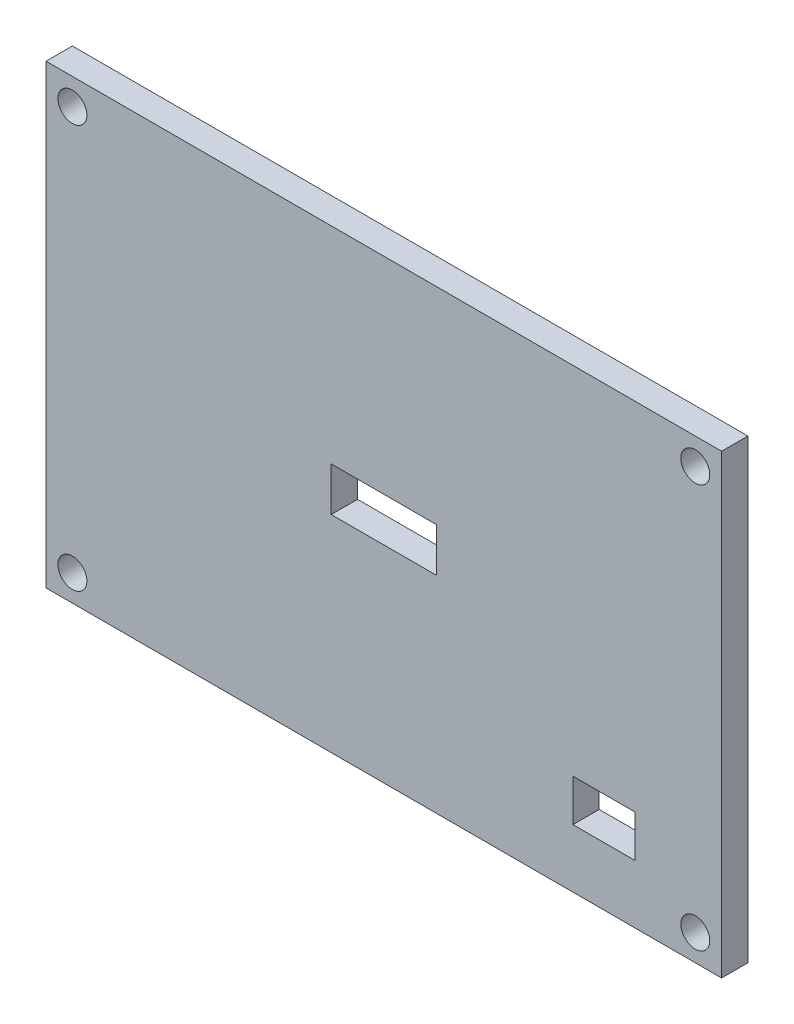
ISO-10303-21;
HEADER;
FILE_DESCRIPTION(('STEP AP214'),'2;1');
FILE_NAME('part.step','',(''),(''),'','','');
FILE_SCHEMA(('AUTOMOTIVE_DESIGN { 1 0 10303 214 1 1 1 1 }'));
ENDSEC;
DATA;
#1=APPLICATION_CONTEXT('core data for automotive mechanical design processes');
#2=APPLICATION_PROTOCOL_DEFINITION('international standard','automotive_design',2000,#1);
#3=PRODUCT_CONTEXT('',#1,'mechanical');
#4=PRODUCT('Part','Part','',(#3));
#5=PRODUCT_RELATED_PRODUCT_CATEGORY('part','',(#4));
#6=PRODUCT_DEFINITION_FORMATION('','',#4);
#7=PRODUCT_DEFINITION_CONTEXT('part definition',#1,'design');
#8=PRODUCT_DEFINITION('design','',#6,#7);
#9=PRODUCT_DEFINITION_SHAPE('','',#8);
#10=(LENGTH_UNIT() NAMED_UNIT(*) SI_UNIT(.MILLI.,.METRE.));
#11=(NAMED_UNIT(*) PLANE_ANGLE_UNIT() SI_UNIT($,.RADIAN.));
#12=(NAMED_UNIT(*) SI_UNIT($,.STERADIAN.) SOLID_ANGLE_UNIT());
#13=UNCERTAINTY_MEASURE_WITH_UNIT(LENGTH_MEASURE(1.E-05),#10,'distance_accuracy_value','');
#14=(GEOMETRIC_REPRESENTATION_CONTEXT(3) GLOBAL_UNCERTAINTY_ASSIGNED_CONTEXT((#13)) GLOBAL_UNIT_ASSIGNED_CONTEXT((#10,
#11,#12)) REPRESENTATION_CONTEXT('',''));
#15=CARTESIAN_POINT('',(0.,0.,0.));
#16=DIRECTION('',(0.,0.,1.));
#17=DIRECTION('',(1.,0.,0.));
#18=AXIS2_PLACEMENT_3D('',#15,#16,#17);
#19=CARTESIAN_POINT('',(0.,0.,3.));
#20=DIRECTION('',(0.,0.,-1.));
#21=DIRECTION('',(-1.,0.,0.));
#22=AXIS2_PLACEMENT_3D('',#19,#20,#21);
#23=PLANE('',#22);
#24=DIRECTION('',(0.,1.,0.));
#25=VECTOR('',#24,1.);
#26=CARTESIAN_POINT('',(6.,-2.5,3.));
#27=LINE('',#26,#25);
#28=CARTESIAN_POINT('',(6.,-2.5,3.));
#29=VERTEX_POINT('',#28);
#30=CARTESIAN_POINT('',(6.,2.5,3.));
#31=VERTEX_POINT('',#30);
#32=EDGE_CURVE('E168',#29,#31,#27,.T.);
#33=ORIENTED_EDGE('',*,*,#32,.F.);
#34=DIRECTION('',(1.,0.,0.));
#35=VECTOR('',#34,1.);
#36=CARTESIAN_POINT('',(-6.,-2.5,3.));
#37=LINE('',#36,#35);
#38=CARTESIAN_POINT('',(-6.,-2.5,3.));
#39=VERTEX_POINT('',#38);
#40=EDGE_CURVE('E176',#39,#29,#37,.T.);
#41=ORIENTED_EDGE('',*,*,#40,.F.);
#42=DIRECTION('',(0.,-1.,0.));
#43=VECTOR('',#42,1.);
#44=CARTESIAN_POINT('',(-6.,-2.5,3.));
#45=LINE('',#44,#43);
#46=CARTESIAN_POINT('',(-6.,2.5,3.));
#47=VERTEX_POINT('',#46);
#48=EDGE_CURVE('E173',#47,#39,#45,.T.);
#49=ORIENTED_EDGE('',*,*,#48,.F.);
#50=DIRECTION('',(-1.,0.,0.));
#51=VECTOR('',#50,1.);
#52=CARTESIAN_POINT('',(-6.,2.5,3.));
#53=LINE('',#52,#51);
#54=EDGE_CURVE('E170',#31,#47,#53,.T.);
#55=ORIENTED_EDGE('',*,*,#54,.F.);
#56=EDGE_LOOP('',(#33,#41,#49,#55));
#57=FACE_BOUND('',#56,.T.);
#58=DIRECTION('',(0.,1.,0.));
#59=VECTOR('',#58,1.);
#60=CARTESIAN_POINT('',(38.5,-26.,3.));
#61=LINE('',#60,#59);
#62=CARTESIAN_POINT('',(38.5,-26.,3.));
#63=VERTEX_POINT('',#62);
#64=CARTESIAN_POINT('',(38.5,26.,3.));
#65=VERTEX_POINT('',#64);
#66=EDGE_CURVE('E223',#63,#65,#61,.T.);
#67=ORIENTED_EDGE('',*,*,#66,.T.);
#68=DIRECTION('',(-1.,0.,0.));
#69=VECTOR('',#68,1.);
#70=CARTESIAN_POINT('',(-38.5,26.,3.));
#71=LINE('',#70,#69);
#72=CARTESIAN_POINT('',(-38.5,26.,3.));
#73=VERTEX_POINT('',#72);
#74=EDGE_CURVE('E226',#65,#73,#71,.T.);
#75=ORIENTED_EDGE('',*,*,#74,.T.);
#76=DIRECTION('',(0.,-1.,0.));
#77=VECTOR('',#76,1.);
#78=CARTESIAN_POINT('',(-38.5,-26.,3.));
#79=LINE('',#78,#77);
#80=CARTESIAN_POINT('',(-38.5,-26.,3.));
#81=VERTEX_POINT('',#80);
#82=EDGE_CURVE('E229',#73,#81,#79,.T.);
#83=ORIENTED_EDGE('',*,*,#82,.T.);
#84=DIRECTION('',(1.,0.,0.));
#85=VECTOR('',#84,1.);
#86=CARTESIAN_POINT('',(-38.5,-26.,3.));
#87=LINE('',#86,#85);
#88=EDGE_CURVE('E231',#81,#63,#87,.T.);
#89=ORIENTED_EDGE('',*,*,#88,.T.);
#90=EDGE_LOOP('',(#67,#75,#83,#89));
#91=FACE_BOUND('',#90,.T.);
#92=CARTESIAN_POINT('',(-35.5,23.,3.));
#93=DIRECTION('',(0.,0.,1.));
#94=DIRECTION('',(1.,0.,0.));
#95=AXIS2_PLACEMENT_3D('',#92,#93,#94);
#96=CIRCLE('',#95,1.65);
#97=CARTESIAN_POINT('',(-33.85,23.,3.));
#98=VERTEX_POINT('',#97);
#99=EDGE_CURVE('E217',#98,#98,#96,.T.);
#100=ORIENTED_EDGE('',*,*,#99,.F.);
#101=EDGE_LOOP('',(#100));
#102=FACE_BOUND('',#101,.T.);
#103=CARTESIAN_POINT('',(35.5,23.,3.));
#104=DIRECTION('',(0.,0.,1.));
#105=DIRECTION('',(-1.,0.,0.));
#106=AXIS2_PLACEMENT_3D('',#103,#104,#105);
#107=CIRCLE('',#106,1.65);
#108=CARTESIAN_POINT('',(33.85,23.,3.));
#109=VERTEX_POINT('',#108);
#110=EDGE_CURVE('E211',#109,#109,#107,.T.);
#111=ORIENTED_EDGE('',*,*,#110,.F.);
#112=EDGE_LOOP('',(#111));
#113=FACE_BOUND('',#112,.T.);
#114=CARTESIAN_POINT('',(35.5,-23.,3.));
#115=DIRECTION('',(0.,0.,1.));
#116=DIRECTION('',(1.,0.,0.));
#117=AXIS2_PLACEMENT_3D('',#114,#115,#116);
#118=CIRCLE('',#117,1.65);
#119=CARTESIAN_POINT('',(37.15,-23.,3.));
#120=VERTEX_POINT('',#119);
#121=EDGE_CURVE('E205',#120,#120,#118,.T.);
#122=ORIENTED_EDGE('',*,*,#121,.F.);
#123=EDGE_LOOP('',(#122));
#124=FACE_BOUND('',#123,.T.);
#125=CARTESIAN_POINT('',(-35.5,-23.,3.));
#126=DIRECTION('',(0.,0.,1.));
#127=DIRECTION('',(-1.,0.,0.));
#128=AXIS2_PLACEMENT_3D('',#125,#126,#127);
#129=CIRCLE('',#128,1.65);
#130=CARTESIAN_POINT('',(-37.15,-23.,3.));
#131=VERTEX_POINT('',#130);
#132=EDGE_CURVE('E199',#131,#131,#129,.T.);
#133=ORIENTED_EDGE('',*,*,#132,.F.);
#134=EDGE_LOOP('',(#133));
#135=FACE_BOUND('',#134,.T.);
#136=DIRECTION('',(0.,1.,0.));
#137=VECTOR('',#136,1.);
#138=CARTESIAN_POINT('',(28.6302930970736,-19.3347433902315,3.));
#139=LINE('',#138,#137);
#140=CARTESIAN_POINT('',(28.6302930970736,-19.3347433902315,3.));
#141=VERTEX_POINT('',#140);
#142=CARTESIAN_POINT('',(28.6302930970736,-14.5530946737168,3.));
#143=VERTEX_POINT('',#142);
#144=EDGE_CURVE('E132',#141,#143,#139,.T.);
#145=ORIENTED_EDGE('',*,*,#144,.F.);
#146=DIRECTION('',(1.,0.,0.));
#147=VECTOR('',#146,1.);
#148=CARTESIAN_POINT('',(28.6302930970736,-19.3347433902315,3.));
#149=LINE('',#148,#147);
#150=CARTESIAN_POINT('',(21.5497748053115,-19.3347433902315,3.));
#151=VERTEX_POINT('',#150);
#152=EDGE_CURVE('E154',#151,#141,#149,.T.);
#153=ORIENTED_EDGE('',*,*,#152,.F.);
#154=DIRECTION('',(0.,-1.,0.));
#155=VECTOR('',#154,1.);
#156=CARTESIAN_POINT('',(21.5497748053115,-19.3347433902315,3.));
#157=LINE('',#156,#155);
#158=CARTESIAN_POINT('',(21.5497748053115,-14.5530946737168,3.));
#159=VERTEX_POINT('',#158);
#160=EDGE_CURVE('E152',#159,#151,#157,.T.);
#161=ORIENTED_EDGE('',*,*,#160,.F.);
#162=DIRECTION('',(-1.,0.,0.));
#163=VECTOR('',#162,1.);
#164=CARTESIAN_POINT('',(28.6302930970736,-14.5530946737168,3.));
#165=LINE('',#164,#163);
#166=EDGE_CURVE('E140',#143,#159,#165,.T.);
#167=ORIENTED_EDGE('',*,*,#166,.F.);
#168=EDGE_LOOP('',(#145,#153,#161,#167));
#169=FACE_BOUND('',#168,.T.);
#170=ADVANCED_FACE('F43',(#57,#91,#102,#113,#124,#135,#169),#23,.F.);
#171=CARTESIAN_POINT('',(0.,0.,0.));
#172=DIRECTION('',(0.,0.,-1.));
#173=DIRECTION('',(-1.,0.,0.));
#174=AXIS2_PLACEMENT_3D('',#171,#172,#173);
#175=PLANE('',#174);
#176=CARTESIAN_POINT('',(35.5,-23.,0.));
#177=DIRECTION('',(0.,0.,1.));
#178=DIRECTION('',(1.,0.,0.));
#179=AXIS2_PLACEMENT_3D('',#176,#177,#178);
#180=CIRCLE('',#179,1.65);
#181=CARTESIAN_POINT('',(37.15,-23.,0.));
#182=VERTEX_POINT('',#181);
#183=EDGE_CURVE('E202',#182,#182,#180,.T.);
#184=ORIENTED_EDGE('',*,*,#183,.T.);
#185=EDGE_LOOP('',(#184));
#186=FACE_BOUND('',#185,.T.);
#187=CARTESIAN_POINT('',(-35.5,23.,0.));
#188=DIRECTION('',(0.,0.,1.));
#189=DIRECTION('',(1.,0.,0.));
#190=AXIS2_PLACEMENT_3D('',#187,#188,#189);
#191=CIRCLE('',#190,1.65);
#192=CARTESIAN_POINT('',(-33.85,23.,0.));
#193=VERTEX_POINT('',#192);
#194=EDGE_CURVE('E214',#193,#193,#191,.T.);
#195=ORIENTED_EDGE('',*,*,#194,.T.);
#196=EDGE_LOOP('',(#195));
#197=FACE_BOUND('',#196,.T.);
#198=DIRECTION('',(0.,1.,0.));
#199=VECTOR('',#198,1.);
#200=CARTESIAN_POINT('',(38.5,-26.,0.));
#201=LINE('',#200,#199);
#202=CARTESIAN_POINT('',(38.5,-26.,0.));
#203=VERTEX_POINT('',#202);
#204=CARTESIAN_POINT('',(38.5,26.,0.));
#205=VERTEX_POINT('',#204);
#206=EDGE_CURVE('E220',#203,#205,#201,.T.);
#207=ORIENTED_EDGE('',*,*,#206,.F.);
#208=DIRECTION('',(1.,0.,0.));
#209=VECTOR('',#208,1.);
#210=CARTESIAN_POINT('',(-38.5,-26.,0.));
#211=LINE('',#210,#209);
#212=CARTESIAN_POINT('',(-38.5,-26.,0.));
#213=VERTEX_POINT('',#212);
#214=EDGE_CURVE('E227',#213,#203,#211,.T.);
#215=ORIENTED_EDGE('',*,*,#214,.F.);
#216=DIRECTION('',(0.,-1.,0.));
#217=VECTOR('',#216,1.);
#218=CARTESIAN_POINT('',(-38.5,-26.,0.));
#219=LINE('',#218,#217);
#220=CARTESIAN_POINT('',(-38.5,26.,0.));
#221=VERTEX_POINT('',#220);
#222=EDGE_CURVE('E238',#221,#213,#219,.T.);
#223=ORIENTED_EDGE('',*,*,#222,.F.);
#224=DIRECTION('',(-1.,0.,0.));
#225=VECTOR('',#224,1.);
#226=CARTESIAN_POINT('',(-38.5,26.,0.));
#227=LINE('',#226,#225);
#228=EDGE_CURVE('E236',#205,#221,#227,.T.);
#229=ORIENTED_EDGE('',*,*,#228,.F.);
#230=EDGE_LOOP('',(#207,#215,#223,#229));
#231=FACE_BOUND('',#230,.T.);
#232=CARTESIAN_POINT('',(35.5,23.,0.));
#233=DIRECTION('',(0.,0.,1.));
#234=DIRECTION('',(-1.,0.,0.));
#235=AXIS2_PLACEMENT_3D('',#232,#233,#234);
#236=CIRCLE('',#235,1.65);
#237=CARTESIAN_POINT('',(33.85,23.,0.));
#238=VERTEX_POINT('',#237);
#239=EDGE_CURVE('E208',#238,#238,#236,.T.);
#240=ORIENTED_EDGE('',*,*,#239,.T.);
#241=EDGE_LOOP('',(#240));
#242=FACE_BOUND('',#241,.T.);
#243=CARTESIAN_POINT('',(-35.5,-23.,0.));
#244=DIRECTION('',(0.,0.,1.));
#245=DIRECTION('',(-1.,0.,0.));
#246=AXIS2_PLACEMENT_3D('',#243,#244,#245);
#247=CIRCLE('',#246,1.65);
#248=CARTESIAN_POINT('',(-37.15,-23.,0.));
#249=VERTEX_POINT('',#248);
#250=EDGE_CURVE('E198',#249,#249,#247,.T.);
#251=ORIENTED_EDGE('',*,*,#250,.T.);
#252=EDGE_LOOP('',(#251));
#253=FACE_BOUND('',#252,.T.);
#254=DIRECTION('',(1.,0.,0.));
#255=VECTOR('',#254,1.);
#256=CARTESIAN_POINT('',(-6.,-2.5,0.));
#257=LINE('',#256,#255);
#258=CARTESIAN_POINT('',(-6.,-2.5,0.));
#259=VERTEX_POINT('',#258);
#260=CARTESIAN_POINT('',(6.,-2.5,0.));
#261=VERTEX_POINT('',#260);
#262=EDGE_CURVE('E171',#259,#261,#257,.T.);
#263=ORIENTED_EDGE('',*,*,#262,.T.);
#264=DIRECTION('',(0.,1.,0.));
#265=VECTOR('',#264,1.);
#266=CARTESIAN_POINT('',(6.,-2.5,0.));
#267=LINE('',#266,#265);
#268=CARTESIAN_POINT('',(6.,2.5,0.));
#269=VERTEX_POINT('',#268);
#270=EDGE_CURVE('E148',#261,#269,#267,.T.);
#271=ORIENTED_EDGE('',*,*,#270,.T.);
#272=DIRECTION('',(-1.,0.,0.));
#273=VECTOR('',#272,1.);
#274=CARTESIAN_POINT('',(-6.,2.5,0.));
#275=LINE('',#274,#273);
#276=CARTESIAN_POINT('',(-6.,2.5,0.));
#277=VERTEX_POINT('',#276);
#278=EDGE_CURVE('E181',#269,#277,#275,.T.);
#279=ORIENTED_EDGE('',*,*,#278,.T.);
#280=DIRECTION('',(0.,-1.,0.));
#281=VECTOR('',#280,1.);
#282=CARTESIAN_POINT('',(-6.,-2.5,0.));
#283=LINE('',#282,#281);
#284=EDGE_CURVE('E184',#277,#259,#283,.T.);
#285=ORIENTED_EDGE('',*,*,#284,.T.);
#286=EDGE_LOOP('',(#263,#271,#279,#285));
#287=FACE_BOUND('',#286,.T.);
#288=DIRECTION('',(1.,0.,0.));
#289=VECTOR('',#288,1.);
#290=CARTESIAN_POINT('',(28.6302930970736,-19.3347433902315,0.));
#291=LINE('',#290,#289);
#292=CARTESIAN_POINT('',(21.5497748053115,-19.3347433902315,0.));
#293=VERTEX_POINT('',#292);
#294=CARTESIAN_POINT('',(28.6302930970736,-19.3347433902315,0.));
#295=VERTEX_POINT('',#294);
#296=EDGE_CURVE('E141',#293,#295,#291,.T.);
#297=ORIENTED_EDGE('',*,*,#296,.T.);
#298=DIRECTION('',(0.,1.,0.));
#299=VECTOR('',#298,1.);
#300=CARTESIAN_POINT('',(28.6302930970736,-19.3347433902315,0.));
#301=LINE('',#300,#299);
#302=CARTESIAN_POINT('',(28.6302930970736,-14.5530946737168,0.));
#303=VERTEX_POINT('',#302);
#304=EDGE_CURVE('E66',#295,#303,#301,.T.);
#305=ORIENTED_EDGE('',*,*,#304,.T.);
#306=DIRECTION('',(-1.,0.,0.));
#307=VECTOR('',#306,1.);
#308=CARTESIAN_POINT('',(28.6302930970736,-14.5530946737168,0.));
#309=LINE('',#308,#307);
#310=CARTESIAN_POINT('',(21.5497748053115,-14.5530946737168,0.));
#311=VERTEX_POINT('',#310);
#312=EDGE_CURVE('E147',#303,#311,#309,.T.);
#313=ORIENTED_EDGE('',*,*,#312,.T.);
#314=DIRECTION('',(0.,-1.,0.));
#315=VECTOR('',#314,1.);
#316=CARTESIAN_POINT('',(21.5497748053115,-19.3347433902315,0.));
#317=LINE('',#316,#315);
#318=EDGE_CURVE('E160',#311,#293,#317,.T.);
#319=ORIENTED_EDGE('',*,*,#318,.T.);
#320=EDGE_LOOP('',(#297,#305,#313,#319));
#321=FACE_BOUND('',#320,.T.);
#322=ADVANCED_FACE('F256',(#186,#197,#231,#242,#253,#287,#321),#175,.T.);
#323=CARTESIAN_POINT('',(38.5,-26.,3.));
#324=DIRECTION('',(-1.,0.,0.));
#325=DIRECTION('',(0.,0.,1.));
#326=AXIS2_PLACEMENT_3D('',#323,#324,#325);
#327=PLANE('',#326);
#328=ORIENTED_EDGE('',*,*,#206,.T.);
#329=DIRECTION('',(0.,0.,-1.));
#330=VECTOR('',#329,1.);
#331=CARTESIAN_POINT('',(38.5,26.,3.));
#332=LINE('',#331,#330);
#333=EDGE_CURVE('E11',#65,#205,#332,.T.);
#334=ORIENTED_EDGE('',*,*,#333,.F.);
#335=ORIENTED_EDGE('',*,*,#66,.F.);
#336=DIRECTION('',(0.,0.,-1.));
#337=VECTOR('',#336,1.);
#338=CARTESIAN_POINT('',(38.5,-26.,3.));
#339=LINE('',#338,#337);
#340=EDGE_CURVE('E233',#63,#203,#339,.T.);
#341=ORIENTED_EDGE('',*,*,#340,.T.);
#342=EDGE_LOOP('',(#328,#334,#335,#341));
#343=FACE_BOUND('',#342,.T.);
#344=ADVANCED_FACE('F45',(#343),#327,.F.);
#345=CARTESIAN_POINT('',(-38.5,26.,3.));
#346=DIRECTION('',(0.,-1.,0.));
#347=DIRECTION('',(0.,0.,-1.));
#348=AXIS2_PLACEMENT_3D('',#345,#346,#347);
#349=PLANE('',#348);
#350=ORIENTED_EDGE('',*,*,#228,.T.);
#351=DIRECTION('',(0.,0.,-1.));
#352=VECTOR('',#351,1.);
#353=CARTESIAN_POINT('',(-38.5,26.,3.));
#354=LINE('',#353,#352);
#355=EDGE_CURVE('E51',#73,#221,#354,.T.);
#356=ORIENTED_EDGE('',*,*,#355,.F.);
#357=ORIENTED_EDGE('',*,*,#74,.F.);
#358=ORIENTED_EDGE('',*,*,#333,.T.);
#359=EDGE_LOOP('',(#350,#356,#357,#358));
#360=FACE_BOUND('',#359,.T.);
#361=ADVANCED_FACE('F267',(#360),#349,.F.);
#362=CARTESIAN_POINT('',(-38.5,-26.,3.));
#363=DIRECTION('',(1.,0.,0.));
#364=DIRECTION('',(0.,0.,-1.));
#365=AXIS2_PLACEMENT_3D('',#362,#363,#364);
#366=PLANE('',#365);
#367=ORIENTED_EDGE('',*,*,#222,.T.);
#368=DIRECTION('',(0.,0.,-1.));
#369=VECTOR('',#368,1.);
#370=CARTESIAN_POINT('',(-38.5,-26.,3.));
#371=LINE('',#370,#369);
#372=EDGE_CURVE('E243',#81,#213,#371,.T.);
#373=ORIENTED_EDGE('',*,*,#372,.F.);
#374=ORIENTED_EDGE('',*,*,#82,.F.);
#375=ORIENTED_EDGE('',*,*,#355,.T.);
#376=EDGE_LOOP('',(#367,#373,#374,#375));
#377=FACE_BOUND('',#376,.T.);
#378=ADVANCED_FACE('F250',(#377),#366,.F.);
#379=CARTESIAN_POINT('',(-38.5,-26.,3.));
#380=DIRECTION('',(0.,1.,0.));
#381=DIRECTION('',(0.,0.,1.));
#382=AXIS2_PLACEMENT_3D('',#379,#380,#381);
#383=PLANE('',#382);
#384=ORIENTED_EDGE('',*,*,#214,.T.);
#385=ORIENTED_EDGE('',*,*,#340,.F.);
#386=ORIENTED_EDGE('',*,*,#88,.F.);
#387=ORIENTED_EDGE('',*,*,#372,.T.);
#388=EDGE_LOOP('',(#384,#385,#386,#387));
#389=FACE_BOUND('',#388,.T.);
#390=ADVANCED_FACE('F260',(#389),#383,.F.);
#391=CARTESIAN_POINT('',(-35.5,23.,3.));
#392=DIRECTION('',(0.,0.,-1.));
#393=DIRECTION('',(-1.,0.,0.));
#394=AXIS2_PLACEMENT_3D('',#391,#392,#393);
#395=CYLINDRICAL_SURFACE('',#394,1.65);
#396=ORIENTED_EDGE('',*,*,#99,.T.);
#397=EDGE_LOOP('',(#396));
#398=FACE_BOUND('',#397,.T.);
#399=ORIENTED_EDGE('',*,*,#194,.F.);
#400=EDGE_LOOP('',(#399));
#401=FACE_BOUND('',#400,.T.);
#402=ADVANCED_FACE('F284',(#398,#401),#395,.F.);
#403=CARTESIAN_POINT('',(35.5,23.,3.));
#404=DIRECTION('',(0.,0.,-1.));
#405=DIRECTION('',(-1.,0.,0.));
#406=AXIS2_PLACEMENT_3D('',#403,#404,#405);
#407=CYLINDRICAL_SURFACE('',#406,1.65);
#408=ORIENTED_EDGE('',*,*,#110,.T.);
#409=EDGE_LOOP('',(#408));
#410=FACE_BOUND('',#409,.T.);
#411=ORIENTED_EDGE('',*,*,#239,.F.);
#412=EDGE_LOOP('',(#411));
#413=FACE_BOUND('',#412,.T.);
#414=ADVANCED_FACE('F291',(#410,#413),#407,.F.);
#415=CARTESIAN_POINT('',(35.5,-23.,3.));
#416=DIRECTION('',(0.,0.,-1.));
#417=DIRECTION('',(-1.,0.,0.));
#418=AXIS2_PLACEMENT_3D('',#415,#416,#417);
#419=CYLINDRICAL_SURFACE('',#418,1.65);
#420=ORIENTED_EDGE('',*,*,#121,.T.);
#421=EDGE_LOOP('',(#420));
#422=FACE_BOUND('',#421,.T.);
#423=ORIENTED_EDGE('',*,*,#183,.F.);
#424=EDGE_LOOP('',(#423));
#425=FACE_BOUND('',#424,.T.);
#426=ADVANCED_FACE('F296',(#422,#425),#419,.F.);
#427=CARTESIAN_POINT('',(-35.5,-23.,3.));
#428=DIRECTION('',(0.,0.,-1.));
#429=DIRECTION('',(-1.,0.,0.));
#430=AXIS2_PLACEMENT_3D('',#427,#428,#429);
#431=CYLINDRICAL_SURFACE('',#430,1.65);
#432=ORIENTED_EDGE('',*,*,#132,.T.);
#433=EDGE_LOOP('',(#432));
#434=FACE_BOUND('',#433,.T.);
#435=ORIENTED_EDGE('',*,*,#250,.F.);
#436=EDGE_LOOP('',(#435));
#437=FACE_BOUND('',#436,.T.);
#438=ADVANCED_FACE('F309',(#434,#437),#431,.F.);
#439=CARTESIAN_POINT('',(6.,-2.5,3.));
#440=DIRECTION('',(-1.,0.,0.));
#441=DIRECTION('',(0.,0.,1.));
#442=AXIS2_PLACEMENT_3D('',#439,#440,#441);
#443=PLANE('',#442);
#444=ORIENTED_EDGE('',*,*,#270,.F.);
#445=DIRECTION('',(0.,0.,-1.));
#446=VECTOR('',#445,1.);
#447=CARTESIAN_POINT('',(6.,-2.5,3.));
#448=LINE('',#447,#446);
#449=EDGE_CURVE('E178',#29,#261,#448,.T.);
#450=ORIENTED_EDGE('',*,*,#449,.F.);
#451=ORIENTED_EDGE('',*,*,#32,.T.);
#452=DIRECTION('',(0.,0.,-1.));
#453=VECTOR('',#452,1.);
#454=CARTESIAN_POINT('',(6.,2.5,3.));
#455=LINE('',#454,#453);
#456=EDGE_CURVE('E195',#31,#269,#455,.T.);
#457=ORIENTED_EDGE('',*,*,#456,.T.);
#458=EDGE_LOOP('',(#444,#450,#451,#457));
#459=FACE_BOUND('',#458,.T.);
#460=ADVANCED_FACE('F312',(#459),#443,.T.);
#461=CARTESIAN_POINT('',(-6.,2.5,3.));
#462=DIRECTION('',(0.,-1.,0.));
#463=DIRECTION('',(0.,0.,-1.));
#464=AXIS2_PLACEMENT_3D('',#461,#462,#463);
#465=PLANE('',#464);
#466=ORIENTED_EDGE('',*,*,#278,.F.);
#467=ORIENTED_EDGE('',*,*,#456,.F.);
#468=ORIENTED_EDGE('',*,*,#54,.T.);
#469=DIRECTION('',(0.,0.,-1.));
#470=VECTOR('',#469,1.);
#471=CARTESIAN_POINT('',(-6.,2.5,3.));
#472=LINE('',#471,#470);
#473=EDGE_CURVE('E193',#47,#277,#472,.T.);
#474=ORIENTED_EDGE('',*,*,#473,.T.);
#475=EDGE_LOOP('',(#466,#467,#468,#474));
#476=FACE_BOUND('',#475,.T.);
#477=ADVANCED_FACE('F341',(#476),#465,.T.);
#478=CARTESIAN_POINT('',(-6.,-2.5,3.));
#479=DIRECTION('',(1.,0.,0.));
#480=DIRECTION('',(0.,0.,-1.));
#481=AXIS2_PLACEMENT_3D('',#478,#479,#480);
#482=PLANE('',#481);
#483=ORIENTED_EDGE('',*,*,#284,.F.);
#484=ORIENTED_EDGE('',*,*,#473,.F.);
#485=ORIENTED_EDGE('',*,*,#48,.T.);
#486=DIRECTION('',(0.,0.,-1.));
#487=VECTOR('',#486,1.);
#488=CARTESIAN_POINT('',(-6.,-2.5,3.));
#489=LINE('',#488,#487);
#490=EDGE_CURVE('E191',#39,#259,#489,.T.);
#491=ORIENTED_EDGE('',*,*,#490,.T.);
#492=EDGE_LOOP('',(#483,#484,#485,#491));
#493=FACE_BOUND('',#492,.T.);
#494=ADVANCED_FACE('F337',(#493),#482,.T.);
#495=CARTESIAN_POINT('',(-6.,-2.5,3.));
#496=DIRECTION('',(0.,1.,0.));
#497=DIRECTION('',(0.,0.,1.));
#498=AXIS2_PLACEMENT_3D('',#495,#496,#497);
#499=PLANE('',#498);
#500=ORIENTED_EDGE('',*,*,#262,.F.);
#501=ORIENTED_EDGE('',*,*,#490,.F.);
#502=ORIENTED_EDGE('',*,*,#40,.T.);
#503=ORIENTED_EDGE('',*,*,#449,.T.);
#504=EDGE_LOOP('',(#500,#501,#502,#503));
#505=FACE_BOUND('',#504,.T.);
#506=ADVANCED_FACE('F334',(#505),#499,.T.);
#507=CARTESIAN_POINT('',(28.6302930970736,-19.3347433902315,3.));
#508=DIRECTION('',(-1.,0.,0.));
#509=DIRECTION('',(0.,0.,1.));
#510=AXIS2_PLACEMENT_3D('',#507,#508,#509);
#511=PLANE('',#510);
#512=ORIENTED_EDGE('',*,*,#304,.F.);
#513=DIRECTION('',(0.,0.,-1.));
#514=VECTOR('',#513,1.);
#515=CARTESIAN_POINT('',(28.6302930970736,-19.3347433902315,3.));
#516=LINE('',#515,#514);
#517=EDGE_CURVE('E136',#141,#295,#516,.T.);
#518=ORIENTED_EDGE('',*,*,#517,.F.);
#519=ORIENTED_EDGE('',*,*,#144,.T.);
#520=DIRECTION('',(0.,0.,-1.));
#521=VECTOR('',#520,1.);
#522=CARTESIAN_POINT('',(28.6302930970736,-14.5530946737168,3.));
#523=LINE('',#522,#521);
#524=EDGE_CURVE('E135',#143,#303,#523,.T.);
#525=ORIENTED_EDGE('',*,*,#524,.T.);
#526=EDGE_LOOP('',(#512,#518,#519,#525));
#527=FACE_BOUND('',#526,.T.);
#528=ADVANCED_FACE('F134',(#527),#511,.T.);
#529=CARTESIAN_POINT('',(28.6302930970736,-14.5530946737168,3.));
#530=DIRECTION('',(0.,-1.,0.));
#531=DIRECTION('',(0.,0.,-1.));
#532=AXIS2_PLACEMENT_3D('',#529,#530,#531);
#533=PLANE('',#532);
#534=ORIENTED_EDGE('',*,*,#312,.F.);
#535=ORIENTED_EDGE('',*,*,#524,.F.);
#536=ORIENTED_EDGE('',*,*,#166,.T.);
#537=DIRECTION('',(0.,0.,-1.));
#538=VECTOR('',#537,1.);
#539=CARTESIAN_POINT('',(21.5497748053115,-14.5530946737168,3.));
#540=LINE('',#539,#538);
#541=EDGE_CURVE('E149',#159,#311,#540,.T.);
#542=ORIENTED_EDGE('',*,*,#541,.T.);
#543=EDGE_LOOP('',(#534,#535,#536,#542));
#544=FACE_BOUND('',#543,.T.);
#545=ADVANCED_FACE('F144',(#544),#533,.T.);
#546=CARTESIAN_POINT('',(21.5497748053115,-19.3347433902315,3.));
#547=DIRECTION('',(1.,0.,0.));
#548=DIRECTION('',(0.,0.,-1.));
#549=AXIS2_PLACEMENT_3D('',#546,#547,#548);
#550=PLANE('',#549);
#551=ORIENTED_EDGE('',*,*,#318,.F.);
#552=ORIENTED_EDGE('',*,*,#541,.F.);
#553=ORIENTED_EDGE('',*,*,#160,.T.);
#554=DIRECTION('',(0.,0.,-1.));
#555=VECTOR('',#554,1.);
#556=CARTESIAN_POINT('',(21.5497748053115,-19.3347433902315,3.));
#557=LINE('',#556,#555);
#558=EDGE_CURVE('E58',#151,#293,#557,.T.);
#559=ORIENTED_EDGE('',*,*,#558,.T.);
#560=EDGE_LOOP('',(#551,#552,#553,#559));
#561=FACE_BOUND('',#560,.T.);
#562=ADVANCED_FACE('F322',(#561),#550,.T.);
#563=CARTESIAN_POINT('',(28.6302930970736,-19.3347433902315,3.));
#564=DIRECTION('',(0.,1.,0.));
#565=DIRECTION('',(0.,0.,1.));
#566=AXIS2_PLACEMENT_3D('',#563,#564,#565);
#567=PLANE('',#566);
#568=ORIENTED_EDGE('',*,*,#296,.F.);
#569=ORIENTED_EDGE('',*,*,#558,.F.);
#570=ORIENTED_EDGE('',*,*,#152,.T.);
#571=ORIENTED_EDGE('',*,*,#517,.T.);
#572=EDGE_LOOP('',(#568,#569,#570,#571));
#573=FACE_BOUND('',#572,.T.);
#574=ADVANCED_FACE('F320',(#573),#567,.T.);
#575=CLOSED_SHELL('',(#170,#322,#344,#361,#378,#390,#402,#414,#426,#438,#460,#477,#494,#506,
#528,#545,#562,#574));
#576=MANIFOLD_SOLID_BREP('B2',#575);
#577=ADVANCED_BREP_SHAPE_REPRESENTATION('',(#18,#576),#14);
#578=SHAPE_DEFINITION_REPRESENTATION(#9,#577);
ENDSEC;
END-ISO-10303-21;
